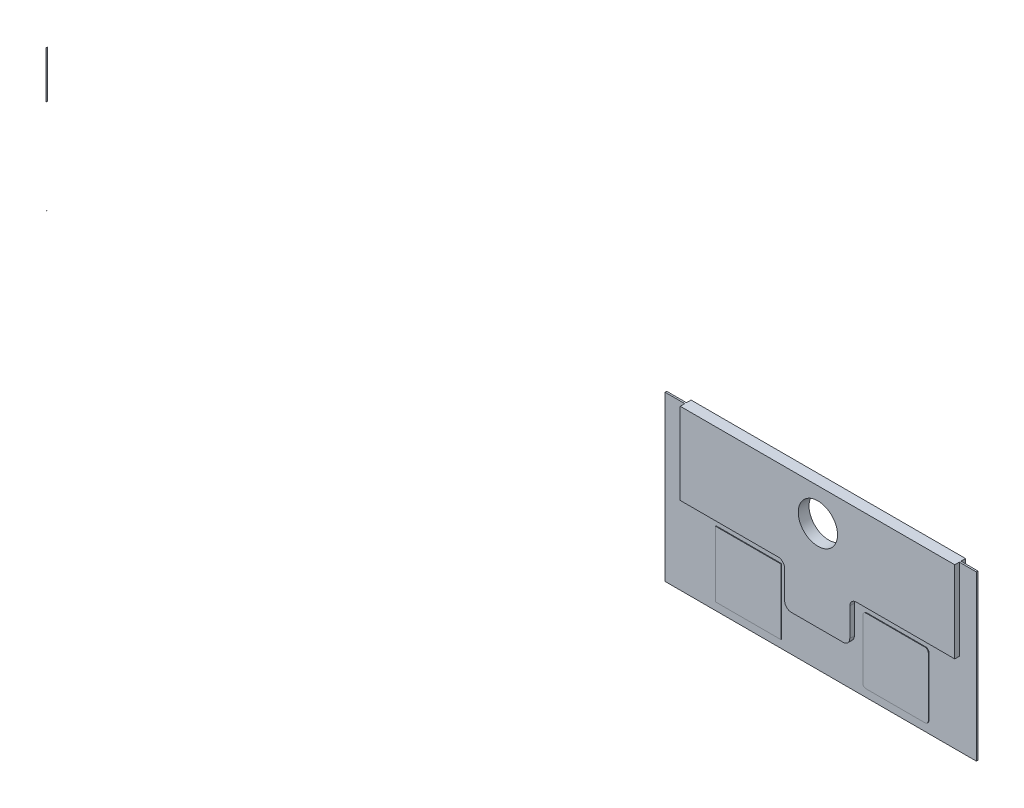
ISO-10303-21;
HEADER;
FILE_DESCRIPTION(('STEP AP214'),'2;1');
FILE_NAME('part.step','',(''),(''),'','','');
FILE_SCHEMA(('AUTOMOTIVE_DESIGN { 1 0 10303 214 1 1 1 1 }'));
ENDSEC;
DATA;
#1=APPLICATION_CONTEXT('core data for automotive mechanical design processes');
#2=APPLICATION_PROTOCOL_DEFINITION('international standard','automotive_design',2000,#1);
#3=PRODUCT_CONTEXT('',#1,'mechanical');
#4=PRODUCT('Part','Part','',(#3));
#5=PRODUCT_RELATED_PRODUCT_CATEGORY('part','',(#4));
#6=PRODUCT_DEFINITION_FORMATION('','',#4);
#7=PRODUCT_DEFINITION_CONTEXT('part definition',#1,'design');
#8=PRODUCT_DEFINITION('design','',#6,#7);
#9=PRODUCT_DEFINITION_SHAPE('','',#8);
#10=(LENGTH_UNIT() NAMED_UNIT(*) SI_UNIT(.MILLI.,.METRE.));
#11=(NAMED_UNIT(*) PLANE_ANGLE_UNIT() SI_UNIT($,.RADIAN.));
#12=(NAMED_UNIT(*) SI_UNIT($,.STERADIAN.) SOLID_ANGLE_UNIT());
#13=UNCERTAINTY_MEASURE_WITH_UNIT(LENGTH_MEASURE(1.E-05),#10,'distance_accuracy_value','');
#14=(GEOMETRIC_REPRESENTATION_CONTEXT(3) GLOBAL_UNCERTAINTY_ASSIGNED_CONTEXT((#13)) GLOBAL_UNIT_ASSIGNED_CONTEXT((#10,
#11,#12)) REPRESENTATION_CONTEXT('',''));
#15=CARTESIAN_POINT('',(0.,0.,0.));
#16=DIRECTION('',(0.,0.,1.));
#17=DIRECTION('',(1.,0.,0.));
#18=AXIS2_PLACEMENT_3D('',#15,#16,#17);
#19=CARTESIAN_POINT('',(0.,0.,0.26416));
#20=DIRECTION('',(0.,0.,1.));
#21=DIRECTION('',(1.,0.,0.));
#22=AXIS2_PLACEMENT_3D('',#19,#20,#21);
#23=PLANE('',#22);
#24=DIRECTION('',(-1.,0.,0.));
#25=VECTOR('',#24,1.);
#26=CARTESIAN_POINT('',(271.018000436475,264.185400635,0.26416));
#27=LINE('',#26,#25);
#28=CARTESIAN_POINT('',(227.604275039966,264.185400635,0.26416));
#29=VERTEX_POINT('',#28);
#30=CARTESIAN_POINT('',(226.283475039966,264.185400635,0.26416));
#31=VERTEX_POINT('',#30);
#32=EDGE_CURVE('E313',#29,#31,#27,.T.);
#33=ORIENTED_EDGE('',*,*,#32,.F.);
#34=DIRECTION('',(0.,-1.,0.));
#35=VECTOR('',#34,1.);
#36=CARTESIAN_POINT('',(227.604275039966,0.,0.26416));
#37=LINE('',#36,#35);
#38=CARTESIAN_POINT('',(227.604275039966,251.47794764,0.26416));
#39=VERTEX_POINT('',#38);
#40=EDGE_CURVE('E302',#29,#39,#37,.T.);
#41=ORIENTED_EDGE('',*,*,#40,.T.);
#42=DIRECTION('',(1.,0.,0.));
#43=VECTOR('',#42,1.);
#44=CARTESIAN_POINT('',(156.337,251.47794764,0.26416));
#45=LINE('',#44,#43);
#46=CARTESIAN_POINT('',(226.283475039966,251.47794764,0.26416));
#47=VERTEX_POINT('',#46);
#48=EDGE_CURVE('E312',#47,#39,#45,.T.);
#49=ORIENTED_EDGE('',*,*,#48,.F.);
#50=DIRECTION('',(0.,-1.,0.));
#51=VECTOR('',#50,1.);
#52=CARTESIAN_POINT('',(226.283475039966,0.,0.26416));
#53=LINE('',#52,#51);
#54=EDGE_CURVE('E405',#31,#47,#53,.T.);
#55=ORIENTED_EDGE('',*,*,#54,.F.);
#56=EDGE_LOOP('',(#33,#41,#49,#55));
#57=FACE_BOUND('',#56,.T.);
#58=ADVANCED_FACE('F97',(#57),#23,.F.);
#59=CARTESIAN_POINT('',(203.474275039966,251.47794764,0.26416));
#60=VERTEX_POINT('',#59);
#61=CARTESIAN_POINT('',(204.998275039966,251.47794764,0.26416));
#62=VERTEX_POINT('',#61);
#63=EDGE_CURVE('E323',#60,#62,#45,.T.);
#64=ORIENTED_EDGE('',*,*,#63,.F.);
#65=DIRECTION('',(0.,1.,0.));
#66=VECTOR('',#65,1.);
#67=CARTESIAN_POINT('',(203.474275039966,0.,0.26416));
#68=LINE('',#67,#66);
#69=CARTESIAN_POINT('',(203.474275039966,264.185400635,0.26416));
#70=VERTEX_POINT('',#69);
#71=EDGE_CURVE('E444',#60,#70,#68,.T.);
#72=ORIENTED_EDGE('',*,*,#71,.T.);
#73=CARTESIAN_POINT('',(204.998275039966,264.185400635,0.26416));
#74=VERTEX_POINT('',#73);
#75=EDGE_CURVE('E331',#74,#70,#27,.T.);
#76=ORIENTED_EDGE('',*,*,#75,.F.);
#77=DIRECTION('',(0.,-1.,0.));
#78=VECTOR('',#77,1.);
#79=CARTESIAN_POINT('',(204.998275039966,0.,0.26416));
#80=LINE('',#79,#78);
#81=EDGE_CURVE('E440',#74,#62,#80,.T.);
#82=ORIENTED_EDGE('',*,*,#81,.T.);
#83=EDGE_LOOP('',(#64,#72,#76,#82));
#84=FACE_BOUND('',#83,.T.);
#85=ADVANCED_FACE('F464',(#84),#23,.F.);
#86=CARTESIAN_POINT('',(0.,0.,0.39116));
#87=DIRECTION('',(0.,0.,1.));
#88=DIRECTION('',(1.,0.,0.));
#89=AXIS2_PLACEMENT_3D('',#86,#87,#88);
#90=PLANE('',#89);
#91=DIRECTION('',(0.,-1.,0.));
#92=VECTOR('',#91,1.);
#93=CARTESIAN_POINT('',(227.604275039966,0.,0.39116));
#94=LINE('',#93,#92);
#95=CARTESIAN_POINT('',(227.604275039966,264.185400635,0.39116));
#96=VERTEX_POINT('',#95);
#97=CARTESIAN_POINT('',(227.604275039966,251.47794764,0.39116));
#98=VERTEX_POINT('',#97);
#99=EDGE_CURVE('E110',#96,#98,#94,.T.);
#100=ORIENTED_EDGE('',*,*,#99,.F.);
#101=DIRECTION('',(-1.,0.,0.));
#102=VECTOR('',#101,1.);
#103=CARTESIAN_POINT('',(271.018000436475,264.185400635,0.39116));
#104=LINE('',#103,#102);
#105=CARTESIAN_POINT('',(226.283475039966,264.185400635,0.39116));
#106=VERTEX_POINT('',#105);
#107=EDGE_CURVE('E380',#96,#106,#104,.T.);
#108=ORIENTED_EDGE('',*,*,#107,.T.);
#109=DIRECTION('',(0.,-1.,0.));
#110=VECTOR('',#109,1.);
#111=CARTESIAN_POINT('',(226.283475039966,0.,0.39116));
#112=LINE('',#111,#110);
#113=CARTESIAN_POINT('',(226.283475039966,257.86194742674,0.39116));
#114=VERTEX_POINT('',#113);
#115=EDGE_CURVE('E377',#106,#114,#112,.T.);
#116=ORIENTED_EDGE('',*,*,#115,.T.);
#117=DIRECTION('',(1.,0.,0.));
#118=VECTOR('',#117,1.);
#119=CARTESIAN_POINT('',(0.,257.86194742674,0.39116));
#120=LINE('',#119,#118);
#121=CARTESIAN_POINT('',(218.650909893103,257.86194742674,0.39116));
#122=VERTEX_POINT('',#121);
#123=EDGE_CURVE('E381',#122,#114,#120,.T.);
#124=ORIENTED_EDGE('',*,*,#123,.F.);
#125=CARTESIAN_POINT('',(218.650909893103,257.35394742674,0.39116));
#126=DIRECTION('',(0.,0.,1.));
#127=DIRECTION('',(1.,0.,0.));
#128=AXIS2_PLACEMENT_3D('',#125,#126,#127);
#129=CIRCLE('',#128,0.508000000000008);
#130=CARTESIAN_POINT('',(218.142909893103,257.35394742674,0.39116));
#131=VERTEX_POINT('',#130);
#132=EDGE_CURVE('E379',#122,#131,#129,.T.);
#133=ORIENTED_EDGE('',*,*,#132,.T.);
#134=DIRECTION('',(0.,-1.,0.));
#135=VECTOR('',#134,1.);
#136=CARTESIAN_POINT('',(218.142909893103,0.,0.39116));
#137=LINE('',#136,#135);
#138=CARTESIAN_POINT('',(218.142909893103,255.16094764,0.39116));
#139=VERTEX_POINT('',#138);
#140=EDGE_CURVE('E387',#131,#139,#137,.T.);
#141=ORIENTED_EDGE('',*,*,#140,.T.);
#142=CARTESIAN_POINT('',(217.634909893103,255.16094764,0.39116));
#143=DIRECTION('',(0.,0.,1.));
#144=DIRECTION('',(1.,0.,0.));
#145=AXIS2_PLACEMENT_3D('',#142,#143,#144);
#146=CIRCLE('',#145,0.508000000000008);
#147=CARTESIAN_POINT('',(217.634909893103,254.65294764,0.39116));
#148=VERTEX_POINT('',#147);
#149=EDGE_CURVE('E389',#139,#148,#146,.F.);
#150=ORIENTED_EDGE('',*,*,#149,.T.);
#151=DIRECTION('',(1.,0.,0.));
#152=VECTOR('',#151,1.);
#153=CARTESIAN_POINT('',(0.,254.65294764,0.39116));
#154=LINE('',#153,#152);
#155=CARTESIAN_POINT('',(213.606791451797,254.65294764,0.39116));
#156=VERTEX_POINT('',#155);
#157=EDGE_CURVE('E392',#156,#148,#154,.T.);
#158=ORIENTED_EDGE('',*,*,#157,.F.);
#159=CARTESIAN_POINT('',(213.606791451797,255.16094764,0.39116));
#160=DIRECTION('',(0.,0.,1.));
#161=DIRECTION('',(1.,0.,0.));
#162=AXIS2_PLACEMENT_3D('',#159,#160,#161);
#163=CIRCLE('',#162,0.508000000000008);
#164=CARTESIAN_POINT('',(213.098791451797,255.16094764,0.39116));
#165=VERTEX_POINT('',#164);
#166=EDGE_CURVE('E391',#156,#165,#163,.F.);
#167=ORIENTED_EDGE('',*,*,#166,.T.);
#168=DIRECTION('',(0.,-1.,0.));
#169=VECTOR('',#168,1.);
#170=CARTESIAN_POINT('',(213.098791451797,0.,0.39116));
#171=LINE('',#170,#169);
#172=CARTESIAN_POINT('',(213.098791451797,257.35394742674,0.39116));
#173=VERTEX_POINT('',#172);
#174=EDGE_CURVE('E371',#173,#165,#171,.T.);
#175=ORIENTED_EDGE('',*,*,#174,.F.);
#176=CARTESIAN_POINT('',(212.590791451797,257.35394742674,0.39116));
#177=DIRECTION('',(0.,0.,1.));
#178=DIRECTION('',(1.,0.,0.));
#179=AXIS2_PLACEMENT_3D('',#176,#177,#178);
#180=CIRCLE('',#179,0.508000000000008);
#181=CARTESIAN_POINT('',(212.590791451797,257.86194742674,0.39116));
#182=VERTEX_POINT('',#181);
#183=EDGE_CURVE('E398',#173,#182,#180,.T.);
#184=ORIENTED_EDGE('',*,*,#183,.T.);
#185=DIRECTION('',(1.,0.,0.));
#186=VECTOR('',#185,1.);
#187=CARTESIAN_POINT('',(0.,257.86194742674,0.39116));
#188=LINE('',#187,#186);
#189=CARTESIAN_POINT('',(204.998275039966,257.86194742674,0.39116));
#190=VERTEX_POINT('',#189);
#191=EDGE_CURVE('E362',#190,#182,#188,.T.);
#192=ORIENTED_EDGE('',*,*,#191,.F.);
#193=DIRECTION('',(0.,-1.,0.));
#194=VECTOR('',#193,1.);
#195=CARTESIAN_POINT('',(204.998275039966,0.,0.39116));
#196=LINE('',#195,#194);
#197=CARTESIAN_POINT('',(204.998275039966,264.185400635,0.39116));
#198=VERTEX_POINT('',#197);
#199=EDGE_CURVE('E363',#198,#190,#196,.T.);
#200=ORIENTED_EDGE('',*,*,#199,.F.);
#201=CARTESIAN_POINT('',(203.474275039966,264.185400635,0.39116));
#202=VERTEX_POINT('',#201);
#203=EDGE_CURVE('E353',#198,#202,#104,.T.);
#204=ORIENTED_EDGE('',*,*,#203,.T.);
#205=DIRECTION('',(0.,1.,0.));
#206=VECTOR('',#205,1.);
#207=CARTESIAN_POINT('',(203.474275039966,0.,0.39116));
#208=LINE('',#207,#206);
#209=CARTESIAN_POINT('',(203.474275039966,251.47794764,0.39116));
#210=VERTEX_POINT('',#209);
#211=EDGE_CURVE('E104',#210,#202,#208,.T.);
#212=ORIENTED_EDGE('',*,*,#211,.F.);
#213=DIRECTION('',(1.,0.,0.));
#214=VECTOR('',#213,1.);
#215=CARTESIAN_POINT('',(156.337,251.47794764,0.39116));
#216=LINE('',#215,#214);
#217=EDGE_CURVE('E443',#210,#98,#216,.T.);
#218=ORIENTED_EDGE('',*,*,#217,.T.);
#219=EDGE_LOOP('',(#100,#108,#116,#124,#133,#141,#150,#158,#167,#175,#184,#192,#200,#204,#212,#218));
#220=FACE_BOUND('',#219,.T.);
#221=DIRECTION('',(1.,0.,0.));
#222=VECTOR('',#221,1.);
#223=CARTESIAN_POINT('',(207.4164,252.11294764,0.39116));
#224=LINE('',#223,#222);
#225=CARTESIAN_POINT('',(207.4164,252.11294764,0.39116));
#226=VERTEX_POINT('',#225);
#227=CARTESIAN_POINT('',(212.4964,252.11294764,0.39116));
#228=VERTEX_POINT('',#227);
#229=EDGE_CURVE('E936',#226,#228,#224,.T.);
#230=ORIENTED_EDGE('',*,*,#229,.F.);
#231=DIRECTION('',(0.,-1.,0.));
#232=VECTOR('',#231,1.);
#233=CARTESIAN_POINT('',(207.4164,257.19294764,0.39116));
#234=LINE('',#233,#232);
#235=CARTESIAN_POINT('',(207.4164,257.19294764,0.39116));
#236=VERTEX_POINT('',#235);
#237=EDGE_CURVE('E931',#236,#226,#234,.T.);
#238=ORIENTED_EDGE('',*,*,#237,.F.);
#239=DIRECTION('',(-1.,0.,0.));
#240=VECTOR('',#239,1.);
#241=CARTESIAN_POINT('',(207.4164,257.19294764,0.39116));
#242=LINE('',#241,#240);
#243=CARTESIAN_POINT('',(212.4964,257.19294764,0.39116));
#244=VERTEX_POINT('',#243);
#245=EDGE_CURVE('E943',#244,#236,#242,.T.);
#246=ORIENTED_EDGE('',*,*,#245,.F.);
#247=DIRECTION('',(0.,1.,0.));
#248=VECTOR('',#247,1.);
#249=CARTESIAN_POINT('',(212.4964,257.19294764,0.39116));
#250=LINE('',#249,#248);
#251=EDGE_CURVE('E939',#228,#244,#250,.T.);
#252=ORIENTED_EDGE('',*,*,#251,.F.);
#253=EDGE_LOOP('',(#230,#238,#246,#252));
#254=FACE_BOUND('',#253,.T.);
#255=DIRECTION('',(0.,-1.,0.));
#256=VECTOR('',#255,1.);
#257=CARTESIAN_POINT('',(218.8464,256.93894764,0.39116));
#258=LINE('',#257,#256);
#259=CARTESIAN_POINT('',(218.8464,256.93894764,0.39116));
#260=VERTEX_POINT('',#259);
#261=CARTESIAN_POINT('',(218.8464,252.36694764,0.39116));
#262=VERTEX_POINT('',#261);
#263=EDGE_CURVE('E971',#260,#262,#258,.T.);
#264=ORIENTED_EDGE('',*,*,#263,.F.);
#265=CARTESIAN_POINT('',(219.1004,256.93894764,0.39116));
#266=DIRECTION('',(0.,0.,1.));
#267=DIRECTION('',(-1.,0.,0.));
#268=AXIS2_PLACEMENT_3D('',#265,#266,#267);
#269=CIRCLE('',#268,0.25399999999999);
#270=CARTESIAN_POINT('',(219.1004,257.19294764,0.39116));
#271=VERTEX_POINT('',#270);
#272=EDGE_CURVE('E452',#271,#260,#269,.T.);
#273=ORIENTED_EDGE('',*,*,#272,.F.);
#274=DIRECTION('',(-1.,0.,0.));
#275=VECTOR('',#274,1.);
#276=CARTESIAN_POINT('',(219.1004,257.19294764,0.39116));
#277=LINE('',#276,#275);
#278=CARTESIAN_POINT('',(223.6724,257.19294764,0.39116));
#279=VERTEX_POINT('',#278);
#280=EDGE_CURVE('E990',#279,#271,#277,.T.);
#281=ORIENTED_EDGE('',*,*,#280,.F.);
#282=CARTESIAN_POINT('',(223.6724,256.93894764,0.39116));
#283=DIRECTION('',(0.,0.,1.));
#284=DIRECTION('',(1.,0.,0.));
#285=AXIS2_PLACEMENT_3D('',#282,#283,#284);
#286=CIRCLE('',#285,0.25399999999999);
#287=CARTESIAN_POINT('',(223.9264,256.93894764,0.39116));
#288=VERTEX_POINT('',#287);
#289=EDGE_CURVE('E986',#288,#279,#286,.T.);
#290=ORIENTED_EDGE('',*,*,#289,.F.);
#291=DIRECTION('',(0.,1.,0.));
#292=VECTOR('',#291,1.);
#293=CARTESIAN_POINT('',(223.9264,256.93894764,0.39116));
#294=LINE('',#293,#292);
#295=CARTESIAN_POINT('',(223.9264,252.36694764,0.39116));
#296=VERTEX_POINT('',#295);
#297=EDGE_CURVE('E983',#296,#288,#294,.T.);
#298=ORIENTED_EDGE('',*,*,#297,.F.);
#299=CARTESIAN_POINT('',(223.6724,252.36694764,0.39116));
#300=DIRECTION('',(0.,0.,1.));
#301=DIRECTION('',(1.,0.,0.));
#302=AXIS2_PLACEMENT_3D('',#299,#300,#301);
#303=CIRCLE('',#302,0.25399999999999);
#304=CARTESIAN_POINT('',(223.6724,252.11294764,0.39116));
#305=VERTEX_POINT('',#304);
#306=EDGE_CURVE('E980',#305,#296,#303,.T.);
#307=ORIENTED_EDGE('',*,*,#306,.F.);
#308=DIRECTION('',(1.,0.,0.));
#309=VECTOR('',#308,1.);
#310=CARTESIAN_POINT('',(219.1004,252.11294764,0.39116));
#311=LINE('',#310,#309);
#312=CARTESIAN_POINT('',(219.1004,252.11294764,0.39116));
#313=VERTEX_POINT('',#312);
#314=EDGE_CURVE('E977',#313,#305,#311,.T.);
#315=ORIENTED_EDGE('',*,*,#314,.F.);
#316=CARTESIAN_POINT('',(219.1004,252.36694764,0.39116));
#317=DIRECTION('',(0.,0.,1.));
#318=DIRECTION('',(-1.,0.,0.));
#319=AXIS2_PLACEMENT_3D('',#316,#317,#318);
#320=CIRCLE('',#319,0.25399999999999);
#321=EDGE_CURVE('E974',#262,#313,#320,.T.);
#322=ORIENTED_EDGE('',*,*,#321,.F.);
#323=EDGE_LOOP('',(#264,#273,#281,#290,#298,#307,#315,#322));
#324=FACE_BOUND('',#323,.T.);
#325=ADVANCED_FACE('F460',(#220,#254,#324),#90,.T.);
#326=CARTESIAN_POINT('',(271.018000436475,264.185400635,0.26416));
#327=DIRECTION('',(0.,1.,0.));
#328=DIRECTION('',(-1.,0.,0.));
#329=AXIS2_PLACEMENT_3D('',#326,#327,#328);
#330=PLANE('',#329);
#331=DIRECTION('',(0.,0.,1.));
#332=VECTOR('',#331,1.);
#333=CARTESIAN_POINT('',(227.604275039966,264.185400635,0.26416));
#334=LINE('',#333,#332);
#335=EDGE_CURVE('E314',#29,#96,#334,.T.);
#336=ORIENTED_EDGE('',*,*,#335,.F.);
#337=ORIENTED_EDGE('',*,*,#32,.T.);
#338=DIRECTION('',(0.,0.,1.));
#339=VECTOR('',#338,1.);
#340=CARTESIAN_POINT('',(226.283475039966,264.185400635,-0.09144));
#341=LINE('',#340,#339);
#342=CARTESIAN_POINT('',(226.283475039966,264.185400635,-0.09144));
#343=VERTEX_POINT('',#342);
#344=EDGE_CURVE('E434',#343,#31,#341,.T.);
#345=ORIENTED_EDGE('',*,*,#344,.F.);
#346=DIRECTION('',(-1.,0.,0.));
#347=VECTOR('',#346,1.);
#348=CARTESIAN_POINT('',(0.,264.185400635,-0.09144));
#349=LINE('',#348,#347);
#350=CARTESIAN_POINT('',(204.998275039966,264.185400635,-0.09144));
#351=VERTEX_POINT('',#350);
#352=EDGE_CURVE('E340',#343,#351,#349,.T.);
#353=ORIENTED_EDGE('',*,*,#352,.T.);
#354=DIRECTION('',(0.,0.,1.));
#355=VECTOR('',#354,1.);
#356=CARTESIAN_POINT('',(204.998275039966,264.185400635,-0.09144));
#357=LINE('',#356,#355);
#358=EDGE_CURVE('E337',#351,#74,#357,.T.);
#359=ORIENTED_EDGE('',*,*,#358,.T.);
#360=ORIENTED_EDGE('',*,*,#75,.T.);
#361=DIRECTION('',(0.,0.,-1.));
#362=VECTOR('',#361,1.);
#363=CARTESIAN_POINT('',(203.474275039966,264.185400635,0.26416));
#364=LINE('',#363,#362);
#365=EDGE_CURVE('E448',#202,#70,#364,.T.);
#366=ORIENTED_EDGE('',*,*,#365,.F.);
#367=ORIENTED_EDGE('',*,*,#203,.F.);
#368=DIRECTION('',(0.,0.,-1.));
#369=VECTOR('',#368,1.);
#370=CARTESIAN_POINT('',(204.998275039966,264.185400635,0.74676));
#371=LINE('',#370,#369);
#372=CARTESIAN_POINT('',(204.998275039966,264.185400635,0.74676));
#373=VERTEX_POINT('',#372);
#374=EDGE_CURVE('E359',#373,#198,#371,.T.);
#375=ORIENTED_EDGE('',*,*,#374,.F.);
#376=DIRECTION('',(1.,0.,0.));
#377=VECTOR('',#376,1.);
#378=CARTESIAN_POINT('',(0.,264.185400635,0.74676));
#379=LINE('',#378,#377);
#380=CARTESIAN_POINT('',(226.283475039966,264.185400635,0.74676));
#381=VERTEX_POINT('',#380);
#382=EDGE_CURVE('E348',#373,#381,#379,.T.);
#383=ORIENTED_EDGE('',*,*,#382,.T.);
#384=DIRECTION('',(0.,0.,-1.));
#385=VECTOR('',#384,1.);
#386=CARTESIAN_POINT('',(226.283475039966,264.185400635,0.74676));
#387=LINE('',#386,#385);
#388=EDGE_CURVE('E343',#381,#106,#387,.T.);
#389=ORIENTED_EDGE('',*,*,#388,.T.);
#390=ORIENTED_EDGE('',*,*,#107,.F.);
#391=EDGE_LOOP('',(#336,#337,#345,#353,#359,#360,#366,#367,#375,#383,#389,#390));
#392=FACE_BOUND('',#391,.T.);
#393=ADVANCED_FACE('F476',(#392),#330,.T.);
#394=CARTESIAN_POINT('',(156.337,251.47794764,0.26416));
#395=DIRECTION('',(0.,-1.,0.));
#396=DIRECTION('',(0.,0.,-1.));
#397=AXIS2_PLACEMENT_3D('',#394,#395,#396);
#398=PLANE('',#397);
#399=DIRECTION('',(0.,0.,-1.));
#400=VECTOR('',#399,1.);
#401=CARTESIAN_POINT('',(227.604275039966,251.47794764,0.26416));
#402=LINE('',#401,#400);
#403=EDGE_CURVE('E13',#98,#39,#402,.T.);
#404=ORIENTED_EDGE('',*,*,#403,.F.);
#405=ORIENTED_EDGE('',*,*,#217,.F.);
#406=DIRECTION('',(0.,0.,1.));
#407=VECTOR('',#406,1.);
#408=CARTESIAN_POINT('',(203.474275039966,251.47794764,0.26416));
#409=LINE('',#408,#407);
#410=EDGE_CURVE('E454',#60,#210,#409,.T.);
#411=ORIENTED_EDGE('',*,*,#410,.F.);
#412=ORIENTED_EDGE('',*,*,#63,.T.);
#413=DIRECTION('',(0.,0.,1.));
#414=VECTOR('',#413,1.);
#415=CARTESIAN_POINT('',(204.998275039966,251.47794764,-0.09144));
#416=LINE('',#415,#414);
#417=CARTESIAN_POINT('',(204.998275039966,251.47794764,-0.09144));
#418=VERTEX_POINT('',#417);
#419=EDGE_CURVE('E437',#418,#62,#416,.T.);
#420=ORIENTED_EDGE('',*,*,#419,.F.);
#421=DIRECTION('',(1.,0.,0.));
#422=VECTOR('',#421,1.);
#423=CARTESIAN_POINT('',(0.,251.47794764,-0.09144));
#424=LINE('',#423,#422);
#425=CARTESIAN_POINT('',(226.283475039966,251.47794764,-0.09144));
#426=VERTEX_POINT('',#425);
#427=EDGE_CURVE('E327',#418,#426,#424,.T.);
#428=ORIENTED_EDGE('',*,*,#427,.T.);
#429=DIRECTION('',(0.,0.,1.));
#430=VECTOR('',#429,1.);
#431=CARTESIAN_POINT('',(226.283475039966,251.47794764,-0.09144));
#432=LINE('',#431,#430);
#433=EDGE_CURVE('E320',#426,#47,#432,.T.);
#434=ORIENTED_EDGE('',*,*,#433,.T.);
#435=ORIENTED_EDGE('',*,*,#48,.T.);
#436=EDGE_LOOP('',(#404,#405,#411,#412,#420,#428,#434,#435));
#437=FACE_BOUND('',#436,.T.);
#438=ADVANCED_FACE('F317',(#437),#398,.T.);
#439=CARTESIAN_POINT('',(215.6714,261.6454,0.26416));
#440=DIRECTION('',(0.,0.,1.));
#441=DIRECTION('',(1.,0.,0.));
#442=AXIS2_PLACEMENT_3D('',#439,#440,#441);
#443=CYLINDRICAL_SURFACE('',#442,1.524);
#444=CARTESIAN_POINT('',(215.6714,261.6454,0.74676));
#445=DIRECTION('',(0.,0.,1.));
#446=DIRECTION('',(1.,0.,0.));
#447=AXIS2_PLACEMENT_3D('',#444,#445,#446);
#448=CIRCLE('',#447,1.524);
#449=CARTESIAN_POINT('',(217.1954,261.6454,0.74676));
#450=VERTEX_POINT('',#449);
#451=EDGE_CURVE('E321',#450,#450,#448,.T.);
#452=ORIENTED_EDGE('',*,*,#451,.T.);
#453=EDGE_LOOP('',(#452));
#454=FACE_BOUND('',#453,.T.);
#455=CARTESIAN_POINT('',(215.6714,261.6454,-0.09144));
#456=DIRECTION('',(0.,0.,-1.));
#457=DIRECTION('',(-1.,0.,0.));
#458=AXIS2_PLACEMENT_3D('',#455,#456,#457);
#459=CIRCLE('',#458,1.524);
#460=CARTESIAN_POINT('',(214.1474,261.6454,-0.09144));
#461=VERTEX_POINT('',#460);
#462=EDGE_CURVE('E325',#461,#461,#459,.T.);
#463=ORIENTED_EDGE('',*,*,#462,.T.);
#464=EDGE_LOOP('',(#463));
#465=FACE_BOUND('',#464,.T.);
#466=ADVANCED_FACE('F483',(#454,#465),#443,.F.);
#467=CARTESIAN_POINT('',(219.1004,256.93894764,0.44196));
#468=DIRECTION('',(0.,0.,-1.));
#469=DIRECTION('',(-1.,0.,0.));
#470=AXIS2_PLACEMENT_3D('',#467,#468,#469);
#471=CYLINDRICAL_SURFACE('',#470,0.25399999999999);
#472=ORIENTED_EDGE('',*,*,#272,.T.);
#473=DIRECTION('',(0.,0.,-1.));
#474=VECTOR('',#473,1.);
#475=CARTESIAN_POINT('',(218.8464,256.93894764,0.44196));
#476=LINE('',#475,#474);
#477=CARTESIAN_POINT('',(218.8464,256.93894764,0.44196));
#478=VERTEX_POINT('',#477);
#479=EDGE_CURVE('E973',#478,#260,#476,.T.);
#480=ORIENTED_EDGE('',*,*,#479,.F.);
#481=CARTESIAN_POINT('',(219.1004,256.93894764,0.44196));
#482=DIRECTION('',(0.,0.,1.));
#483=DIRECTION('',(-1.,0.,0.));
#484=AXIS2_PLACEMENT_3D('',#481,#482,#483);
#485=CIRCLE('',#484,0.25399999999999);
#486=CARTESIAN_POINT('',(219.1004,257.19294764,0.44196));
#487=VERTEX_POINT('',#486);
#488=EDGE_CURVE('E951',#487,#478,#485,.T.);
#489=ORIENTED_EDGE('',*,*,#488,.F.);
#490=DIRECTION('',(0.,0.,-1.));
#491=VECTOR('',#490,1.);
#492=CARTESIAN_POINT('',(219.1004,257.19294764,0.44196));
#493=LINE('',#492,#491);
#494=EDGE_CURVE('E970',#487,#271,#493,.T.);
#495=ORIENTED_EDGE('',*,*,#494,.T.);
#496=EDGE_LOOP('',(#472,#480,#489,#495));
#497=FACE_BOUND('',#496,.T.);
#498=ADVANCED_FACE('F748',(#497),#471,.T.);
#499=CARTESIAN_POINT('',(218.8464,256.93894764,0.44196));
#500=DIRECTION('',(1.,0.,0.));
#501=DIRECTION('',(0.,0.,-1.));
#502=AXIS2_PLACEMENT_3D('',#499,#500,#501);
#503=PLANE('',#502);
#504=ORIENTED_EDGE('',*,*,#263,.T.);
#505=DIRECTION('',(0.,0.,-1.));
#506=VECTOR('',#505,1.);
#507=CARTESIAN_POINT('',(218.8464,252.36694764,0.44196));
#508=LINE('',#507,#506);
#509=CARTESIAN_POINT('',(218.8464,252.36694764,0.44196));
#510=VERTEX_POINT('',#509);
#511=EDGE_CURVE('E976',#510,#262,#508,.T.);
#512=ORIENTED_EDGE('',*,*,#511,.F.);
#513=DIRECTION('',(0.,-1.,0.));
#514=VECTOR('',#513,1.);
#515=CARTESIAN_POINT('',(218.8464,256.93894764,0.44196));
#516=LINE('',#515,#514);
#517=EDGE_CURVE('E954',#478,#510,#516,.T.);
#518=ORIENTED_EDGE('',*,*,#517,.F.);
#519=ORIENTED_EDGE('',*,*,#479,.T.);
#520=EDGE_LOOP('',(#504,#512,#518,#519));
#521=FACE_BOUND('',#520,.T.);
#522=ADVANCED_FACE('F740',(#521),#503,.F.);
#523=CARTESIAN_POINT('',(219.1004,252.36694764,0.44196));
#524=DIRECTION('',(0.,0.,-1.));
#525=DIRECTION('',(-1.,0.,0.));
#526=AXIS2_PLACEMENT_3D('',#523,#524,#525);
#527=CYLINDRICAL_SURFACE('',#526,0.25399999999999);
#528=ORIENTED_EDGE('',*,*,#321,.T.);
#529=DIRECTION('',(0.,0.,-1.));
#530=VECTOR('',#529,1.);
#531=CARTESIAN_POINT('',(219.1004,252.11294764,0.44196));
#532=LINE('',#531,#530);
#533=CARTESIAN_POINT('',(219.1004,252.11294764,0.44196));
#534=VERTEX_POINT('',#533);
#535=EDGE_CURVE('E979',#534,#313,#532,.T.);
#536=ORIENTED_EDGE('',*,*,#535,.F.);
#537=CARTESIAN_POINT('',(219.1004,252.36694764,0.44196));
#538=DIRECTION('',(0.,0.,1.));
#539=DIRECTION('',(-1.,0.,0.));
#540=AXIS2_PLACEMENT_3D('',#537,#538,#539);
#541=CIRCLE('',#540,0.25399999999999);
#542=EDGE_CURVE('E957',#510,#534,#541,.T.);
#543=ORIENTED_EDGE('',*,*,#542,.F.);
#544=ORIENTED_EDGE('',*,*,#511,.T.);
#545=EDGE_LOOP('',(#528,#536,#543,#544));
#546=FACE_BOUND('',#545,.T.);
#547=ADVANCED_FACE('F732',(#546),#527,.T.);
#548=CARTESIAN_POINT('',(219.1004,252.11294764,0.44196));
#549=DIRECTION('',(0.,1.,0.));
#550=DIRECTION('',(0.,0.,1.));
#551=AXIS2_PLACEMENT_3D('',#548,#549,#550);
#552=PLANE('',#551);
#553=ORIENTED_EDGE('',*,*,#314,.T.);
#554=DIRECTION('',(0.,0.,-1.));
#555=VECTOR('',#554,1.);
#556=CARTESIAN_POINT('',(223.6724,252.11294764,0.44196));
#557=LINE('',#556,#555);
#558=CARTESIAN_POINT('',(223.6724,252.11294764,0.44196));
#559=VERTEX_POINT('',#558);
#560=EDGE_CURVE('E982',#559,#305,#557,.T.);
#561=ORIENTED_EDGE('',*,*,#560,.F.);
#562=DIRECTION('',(1.,0.,0.));
#563=VECTOR('',#562,1.);
#564=CARTESIAN_POINT('',(219.1004,252.11294764,0.44196));
#565=LINE('',#564,#563);
#566=EDGE_CURVE('E959',#534,#559,#565,.T.);
#567=ORIENTED_EDGE('',*,*,#566,.F.);
#568=ORIENTED_EDGE('',*,*,#535,.T.);
#569=EDGE_LOOP('',(#553,#561,#567,#568));
#570=FACE_BOUND('',#569,.T.);
#571=ADVANCED_FACE('F724',(#570),#552,.F.);
#572=CARTESIAN_POINT('',(223.6724,252.36694764,0.44196));
#573=DIRECTION('',(0.,0.,-1.));
#574=DIRECTION('',(-1.,0.,0.));
#575=AXIS2_PLACEMENT_3D('',#572,#573,#574);
#576=CYLINDRICAL_SURFACE('',#575,0.25399999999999);
#577=ORIENTED_EDGE('',*,*,#306,.T.);
#578=DIRECTION('',(0.,0.,-1.));
#579=VECTOR('',#578,1.);
#580=CARTESIAN_POINT('',(223.9264,252.36694764,0.44196));
#581=LINE('',#580,#579);
#582=CARTESIAN_POINT('',(223.9264,252.36694764,0.44196));
#583=VERTEX_POINT('',#582);
#584=EDGE_CURVE('E985',#583,#296,#581,.T.);
#585=ORIENTED_EDGE('',*,*,#584,.F.);
#586=CARTESIAN_POINT('',(223.6724,252.36694764,0.44196));
#587=DIRECTION('',(0.,0.,1.));
#588=DIRECTION('',(1.,0.,0.));
#589=AXIS2_PLACEMENT_3D('',#586,#587,#588);
#590=CIRCLE('',#589,0.25399999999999);
#591=EDGE_CURVE('E961',#559,#583,#590,.T.);
#592=ORIENTED_EDGE('',*,*,#591,.F.);
#593=ORIENTED_EDGE('',*,*,#560,.T.);
#594=EDGE_LOOP('',(#577,#585,#592,#593));
#595=FACE_BOUND('',#594,.T.);
#596=ADVANCED_FACE('F716',(#595),#576,.T.);
#597=CARTESIAN_POINT('',(223.9264,256.93894764,0.44196));
#598=DIRECTION('',(-1.,0.,0.));
#599=DIRECTION('',(0.,0.,1.));
#600=AXIS2_PLACEMENT_3D('',#597,#598,#599);
#601=PLANE('',#600);
#602=ORIENTED_EDGE('',*,*,#297,.T.);
#603=DIRECTION('',(0.,0.,-1.));
#604=VECTOR('',#603,1.);
#605=CARTESIAN_POINT('',(223.9264,256.93894764,0.44196));
#606=LINE('',#605,#604);
#607=CARTESIAN_POINT('',(223.9264,256.93894764,0.44196));
#608=VERTEX_POINT('',#607);
#609=EDGE_CURVE('E989',#608,#288,#606,.T.);
#610=ORIENTED_EDGE('',*,*,#609,.F.);
#611=DIRECTION('',(0.,1.,0.));
#612=VECTOR('',#611,1.);
#613=CARTESIAN_POINT('',(223.9264,256.93894764,0.44196));
#614=LINE('',#613,#612);
#615=EDGE_CURVE('E963',#583,#608,#614,.T.);
#616=ORIENTED_EDGE('',*,*,#615,.F.);
#617=ORIENTED_EDGE('',*,*,#584,.T.);
#618=EDGE_LOOP('',(#602,#610,#616,#617));
#619=FACE_BOUND('',#618,.T.);
#620=ADVANCED_FACE('F708',(#619),#601,.F.);
#621=CARTESIAN_POINT('',(223.6724,256.93894764,0.44196));
#622=DIRECTION('',(0.,0.,-1.));
#623=DIRECTION('',(-1.,0.,0.));
#624=AXIS2_PLACEMENT_3D('',#621,#622,#623);
#625=CYLINDRICAL_SURFACE('',#624,0.25399999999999);
#626=ORIENTED_EDGE('',*,*,#289,.T.);
#627=DIRECTION('',(0.,0.,-1.));
#628=VECTOR('',#627,1.);
#629=CARTESIAN_POINT('',(223.6724,257.19294764,0.44196));
#630=LINE('',#629,#628);
#631=CARTESIAN_POINT('',(223.6724,257.19294764,0.44196));
#632=VERTEX_POINT('',#631);
#633=EDGE_CURVE('E955',#632,#279,#630,.T.);
#634=ORIENTED_EDGE('',*,*,#633,.F.);
#635=CARTESIAN_POINT('',(223.6724,256.93894764,0.44196));
#636=DIRECTION('',(0.,0.,1.));
#637=DIRECTION('',(1.,0.,0.));
#638=AXIS2_PLACEMENT_3D('',#635,#636,#637);
#639=CIRCLE('',#638,0.25399999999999);
#640=EDGE_CURVE('E965',#608,#632,#639,.T.);
#641=ORIENTED_EDGE('',*,*,#640,.F.);
#642=ORIENTED_EDGE('',*,*,#609,.T.);
#643=EDGE_LOOP('',(#626,#634,#641,#642));
#644=FACE_BOUND('',#643,.T.);
#645=ADVANCED_FACE('F700',(#644),#625,.T.);
#646=CARTESIAN_POINT('',(219.1004,257.19294764,0.44196));
#647=DIRECTION('',(0.,-1.,0.));
#648=DIRECTION('',(0.,0.,-1.));
#649=AXIS2_PLACEMENT_3D('',#646,#647,#648);
#650=PLANE('',#649);
#651=ORIENTED_EDGE('',*,*,#280,.T.);
#652=ORIENTED_EDGE('',*,*,#494,.F.);
#653=DIRECTION('',(-1.,0.,0.));
#654=VECTOR('',#653,1.);
#655=CARTESIAN_POINT('',(219.1004,257.19294764,0.44196));
#656=LINE('',#655,#654);
#657=EDGE_CURVE('E935',#632,#487,#656,.T.);
#658=ORIENTED_EDGE('',*,*,#657,.F.);
#659=ORIENTED_EDGE('',*,*,#633,.T.);
#660=EDGE_LOOP('',(#651,#652,#658,#659));
#661=FACE_BOUND('',#660,.T.);
#662=ADVANCED_FACE('F692',(#661),#650,.F.);
#663=CARTESIAN_POINT('',(219.1004,256.93894764,0.44196));
#664=DIRECTION('',(0.,0.,-1.));
#665=DIRECTION('',(-1.,0.,0.));
#666=AXIS2_PLACEMENT_3D('',#663,#664,#665);
#667=PLANE('',#666);
#668=ORIENTED_EDGE('',*,*,#488,.T.);
#669=ORIENTED_EDGE('',*,*,#517,.T.);
#670=ORIENTED_EDGE('',*,*,#542,.T.);
#671=ORIENTED_EDGE('',*,*,#566,.T.);
#672=ORIENTED_EDGE('',*,*,#591,.T.);
#673=ORIENTED_EDGE('',*,*,#615,.T.);
#674=ORIENTED_EDGE('',*,*,#640,.T.);
#675=ORIENTED_EDGE('',*,*,#657,.T.);
#676=EDGE_LOOP('',(#668,#669,#670,#671,#672,#673,#674,#675));
#677=FACE_BOUND('',#676,.T.);
#678=ADVANCED_FACE('F684',(#677),#667,.F.);
#679=CARTESIAN_POINT('',(207.4164,257.19294764,0.44196));
#680=DIRECTION('',(1.,0.,0.));
#681=DIRECTION('',(0.,0.,-1.));
#682=AXIS2_PLACEMENT_3D('',#679,#680,#681);
#683=PLANE('',#682);
#684=ORIENTED_EDGE('',*,*,#237,.T.);
#685=DIRECTION('',(0.,0.,-1.));
#686=VECTOR('',#685,1.);
#687=CARTESIAN_POINT('',(207.4164,252.11294764,0.44196));
#688=LINE('',#687,#686);
#689=CARTESIAN_POINT('',(207.4164,252.11294764,0.44196));
#690=VERTEX_POINT('',#689);
#691=EDGE_CURVE('E938',#690,#226,#688,.T.);
#692=ORIENTED_EDGE('',*,*,#691,.F.);
#693=DIRECTION('',(0.,-1.,0.));
#694=VECTOR('',#693,1.);
#695=CARTESIAN_POINT('',(207.4164,257.19294764,0.44196));
#696=LINE('',#695,#694);
#697=CARTESIAN_POINT('',(207.4164,257.19294764,0.44196));
#698=VERTEX_POINT('',#697);
#699=EDGE_CURVE('E922',#698,#690,#696,.T.);
#700=ORIENTED_EDGE('',*,*,#699,.F.);
#701=DIRECTION('',(0.,0.,-1.));
#702=VECTOR('',#701,1.);
#703=CARTESIAN_POINT('',(207.4164,257.19294764,0.44196));
#704=LINE('',#703,#702);
#705=EDGE_CURVE('E934',#698,#236,#704,.T.);
#706=ORIENTED_EDGE('',*,*,#705,.T.);
#707=EDGE_LOOP('',(#684,#692,#700,#706));
#708=FACE_BOUND('',#707,.T.);
#709=ADVANCED_FACE('F676',(#708),#683,.F.);
#710=CARTESIAN_POINT('',(207.4164,252.11294764,0.44196));
#711=DIRECTION('',(0.,1.,0.));
#712=DIRECTION('',(0.,0.,1.));
#713=AXIS2_PLACEMENT_3D('',#710,#711,#712);
#714=PLANE('',#713);
#715=ORIENTED_EDGE('',*,*,#229,.T.);
#716=DIRECTION('',(0.,0.,-1.));
#717=VECTOR('',#716,1.);
#718=CARTESIAN_POINT('',(212.4964,252.11294764,0.44196));
#719=LINE('',#718,#717);
#720=CARTESIAN_POINT('',(212.4964,252.11294764,0.44196));
#721=VERTEX_POINT('',#720);
#722=EDGE_CURVE('E942',#721,#228,#719,.T.);
#723=ORIENTED_EDGE('',*,*,#722,.F.);
#724=DIRECTION('',(1.,0.,0.));
#725=VECTOR('',#724,1.);
#726=CARTESIAN_POINT('',(207.4164,252.11294764,0.44196));
#727=LINE('',#726,#725);
#728=EDGE_CURVE('E925',#690,#721,#727,.T.);
#729=ORIENTED_EDGE('',*,*,#728,.F.);
#730=ORIENTED_EDGE('',*,*,#691,.T.);
#731=EDGE_LOOP('',(#715,#723,#729,#730));
#732=FACE_BOUND('',#731,.T.);
#733=ADVANCED_FACE('F668',(#732),#714,.F.);
#734=CARTESIAN_POINT('',(212.4964,257.19294764,0.44196));
#735=DIRECTION('',(-1.,0.,0.));
#736=DIRECTION('',(0.,0.,1.));
#737=AXIS2_PLACEMENT_3D('',#734,#735,#736);
#738=PLANE('',#737);
#739=ORIENTED_EDGE('',*,*,#251,.T.);
#740=DIRECTION('',(0.,0.,-1.));
#741=VECTOR('',#740,1.);
#742=CARTESIAN_POINT('',(212.4964,257.19294764,0.44196));
#743=LINE('',#742,#741);
#744=CARTESIAN_POINT('',(212.4964,257.19294764,0.44196));
#745=VERTEX_POINT('',#744);
#746=EDGE_CURVE('E926',#745,#244,#743,.T.);
#747=ORIENTED_EDGE('',*,*,#746,.F.);
#748=DIRECTION('',(0.,1.,0.));
#749=VECTOR('',#748,1.);
#750=CARTESIAN_POINT('',(212.4964,257.19294764,0.44196));
#751=LINE('',#750,#749);
#752=EDGE_CURVE('E928',#721,#745,#751,.T.);
#753=ORIENTED_EDGE('',*,*,#752,.F.);
#754=ORIENTED_EDGE('',*,*,#722,.T.);
#755=EDGE_LOOP('',(#739,#747,#753,#754));
#756=FACE_BOUND('',#755,.T.);
#757=ADVANCED_FACE('F660',(#756),#738,.F.);
#758=CARTESIAN_POINT('',(207.4164,257.19294764,0.44196));
#759=DIRECTION('',(0.,-1.,0.));
#760=DIRECTION('',(0.,0.,-1.));
#761=AXIS2_PLACEMENT_3D('',#758,#759,#760);
#762=PLANE('',#761);
#763=ORIENTED_EDGE('',*,*,#245,.T.);
#764=ORIENTED_EDGE('',*,*,#705,.F.);
#765=DIRECTION('',(-1.,0.,0.));
#766=VECTOR('',#765,1.);
#767=CARTESIAN_POINT('',(207.4164,257.19294764,0.44196));
#768=LINE('',#767,#766);
#769=EDGE_CURVE('E432',#745,#698,#768,.T.);
#770=ORIENTED_EDGE('',*,*,#769,.F.);
#771=ORIENTED_EDGE('',*,*,#746,.T.);
#772=EDGE_LOOP('',(#763,#764,#770,#771));
#773=FACE_BOUND('',#772,.T.);
#774=ADVANCED_FACE('F652',(#773),#762,.F.);
#775=CARTESIAN_POINT('',(0.,0.,0.44196));
#776=DIRECTION('',(0.,0.,1.));
#777=DIRECTION('',(1.,0.,0.));
#778=AXIS2_PLACEMENT_3D('',#775,#776,#777);
#779=PLANE('',#778);
#780=ORIENTED_EDGE('',*,*,#699,.T.);
#781=ORIENTED_EDGE('',*,*,#728,.T.);
#782=ORIENTED_EDGE('',*,*,#752,.T.);
#783=ORIENTED_EDGE('',*,*,#769,.T.);
#784=EDGE_LOOP('',(#780,#781,#782,#783));
#785=FACE_BOUND('',#784,.T.);
#786=ADVANCED_FACE('F644',(#785),#779,.T.);
#787=CARTESIAN_POINT('',(212.590791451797,257.35394742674,0.74676));
#788=DIRECTION('',(0.,0.,-1.));
#789=DIRECTION('',(-1.,0.,0.));
#790=AXIS2_PLACEMENT_3D('',#787,#788,#789);
#791=CYLINDRICAL_SURFACE('',#790,0.508000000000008);
#792=ORIENTED_EDGE('',*,*,#183,.F.);
#793=DIRECTION('',(0.,0.,-1.));
#794=VECTOR('',#793,1.);
#795=CARTESIAN_POINT('',(213.098791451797,257.35394742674,0.74676));
#796=LINE('',#795,#794);
#797=CARTESIAN_POINT('',(213.098791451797,257.35394742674,0.74676));
#798=VERTEX_POINT('',#797);
#799=EDGE_CURVE('E401',#798,#173,#796,.T.);
#800=ORIENTED_EDGE('',*,*,#799,.F.);
#801=CARTESIAN_POINT('',(212.590791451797,257.35394742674,0.74676));
#802=DIRECTION('',(0.,0.,1.));
#803=DIRECTION('',(1.,0.,0.));
#804=AXIS2_PLACEMENT_3D('',#801,#802,#803);
#805=CIRCLE('',#804,0.508000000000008);
#806=CARTESIAN_POINT('',(212.590791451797,257.86194742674,0.74676));
#807=VERTEX_POINT('',#806);
#808=EDGE_CURVE('E372',#798,#807,#805,.T.);
#809=ORIENTED_EDGE('',*,*,#808,.T.);
#810=DIRECTION('',(0.,0.,-1.));
#811=VECTOR('',#810,1.);
#812=CARTESIAN_POINT('',(212.590791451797,257.86194742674,0.74676));
#813=LINE('',#812,#811);
#814=EDGE_CURVE('E368',#807,#182,#813,.T.);
#815=ORIENTED_EDGE('',*,*,#814,.T.);
#816=EDGE_LOOP('',(#792,#800,#809,#815));
#817=FACE_BOUND('',#816,.T.);
#818=ADVANCED_FACE('F636',(#817),#791,.F.);
#819=CARTESIAN_POINT('',(213.098791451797,0.,0.74676));
#820=DIRECTION('',(1.,0.,0.));
#821=DIRECTION('',(0.,0.,-1.));
#822=AXIS2_PLACEMENT_3D('',#819,#820,#821);
#823=PLANE('',#822);
#824=ORIENTED_EDGE('',*,*,#174,.T.);
#825=DIRECTION('',(0.,0.,-1.));
#826=VECTOR('',#825,1.);
#827=CARTESIAN_POINT('',(213.098791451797,255.16094764,0.74676));
#828=LINE('',#827,#826);
#829=CARTESIAN_POINT('',(213.098791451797,255.16094764,0.74676));
#830=VERTEX_POINT('',#829);
#831=EDGE_CURVE('E396',#830,#165,#828,.T.);
#832=ORIENTED_EDGE('',*,*,#831,.F.);
#833=DIRECTION('',(0.,-1.,0.));
#834=VECTOR('',#833,1.);
#835=CARTESIAN_POINT('',(213.098791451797,0.,0.74676));
#836=LINE('',#835,#834);
#837=EDGE_CURVE('E367',#798,#830,#836,.T.);
#838=ORIENTED_EDGE('',*,*,#837,.F.);
#839=ORIENTED_EDGE('',*,*,#799,.T.);
#840=EDGE_LOOP('',(#824,#832,#838,#839));
#841=FACE_BOUND('',#840,.T.);
#842=ADVANCED_FACE('F628',(#841),#823,.F.);
#843=CARTESIAN_POINT('',(213.606791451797,255.16094764,0.74676));
#844=DIRECTION('',(0.,0.,-1.));
#845=DIRECTION('',(-1.,0.,0.));
#846=AXIS2_PLACEMENT_3D('',#843,#844,#845);
#847=CYLINDRICAL_SURFACE('',#846,0.508000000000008);
#848=ORIENTED_EDGE('',*,*,#166,.F.);
#849=DIRECTION('',(0.,0.,-1.));
#850=VECTOR('',#849,1.);
#851=CARTESIAN_POINT('',(213.606791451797,254.65294764,0.74676));
#852=LINE('',#851,#850);
#853=CARTESIAN_POINT('',(213.606791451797,254.65294764,0.74676));
#854=VERTEX_POINT('',#853);
#855=EDGE_CURVE('E395',#854,#156,#852,.T.);
#856=ORIENTED_EDGE('',*,*,#855,.F.);
#857=CARTESIAN_POINT('',(213.606791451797,255.16094764,0.74676));
#858=DIRECTION('',(0.,0.,1.));
#859=DIRECTION('',(1.,0.,0.));
#860=AXIS2_PLACEMENT_3D('',#857,#858,#859);
#861=CIRCLE('',#860,0.508000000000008);
#862=EDGE_CURVE('E427',#854,#830,#861,.F.);
#863=ORIENTED_EDGE('',*,*,#862,.T.);
#864=ORIENTED_EDGE('',*,*,#831,.T.);
#865=EDGE_LOOP('',(#848,#856,#863,#864));
#866=FACE_BOUND('',#865,.T.);
#867=ADVANCED_FACE('F620',(#866),#847,.T.);
#868=CARTESIAN_POINT('',(0.,254.65294764,0.74676));
#869=DIRECTION('',(0.,1.,0.));
#870=DIRECTION('',(0.,0.,1.));
#871=AXIS2_PLACEMENT_3D('',#868,#869,#870);
#872=PLANE('',#871);
#873=ORIENTED_EDGE('',*,*,#157,.T.);
#874=DIRECTION('',(0.,0.,-1.));
#875=VECTOR('',#874,1.);
#876=CARTESIAN_POINT('',(217.634909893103,254.65294764,0.74676));
#877=LINE('',#876,#875);
#878=CARTESIAN_POINT('',(217.634909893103,254.65294764,0.74676));
#879=VERTEX_POINT('',#878);
#880=EDGE_CURVE('E422',#879,#148,#877,.T.);
#881=ORIENTED_EDGE('',*,*,#880,.F.);
#882=DIRECTION('',(1.,0.,0.));
#883=VECTOR('',#882,1.);
#884=CARTESIAN_POINT('',(0.,254.65294764,0.74676));
#885=LINE('',#884,#883);
#886=EDGE_CURVE('E414',#854,#879,#885,.T.);
#887=ORIENTED_EDGE('',*,*,#886,.F.);
#888=ORIENTED_EDGE('',*,*,#855,.T.);
#889=EDGE_LOOP('',(#873,#881,#887,#888));
#890=FACE_BOUND('',#889,.T.);
#891=ADVANCED_FACE('F612',(#890),#872,.F.);
#892=CARTESIAN_POINT('',(217.634909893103,255.16094764,0.74676));
#893=DIRECTION('',(0.,0.,-1.));
#894=DIRECTION('',(-1.,0.,0.));
#895=AXIS2_PLACEMENT_3D('',#892,#893,#894);
#896=CYLINDRICAL_SURFACE('',#895,0.508000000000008);
#897=ORIENTED_EDGE('',*,*,#149,.F.);
#898=DIRECTION('',(0.,0.,-1.));
#899=VECTOR('',#898,1.);
#900=CARTESIAN_POINT('',(218.142909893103,255.16094764,0.74676));
#901=LINE('',#900,#899);
#902=CARTESIAN_POINT('',(218.142909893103,255.16094764,0.74676));
#903=VERTEX_POINT('',#902);
#904=EDGE_CURVE('E418',#903,#139,#901,.T.);
#905=ORIENTED_EDGE('',*,*,#904,.F.);
#906=CARTESIAN_POINT('',(217.634909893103,255.16094764,0.74676));
#907=DIRECTION('',(0.,0.,1.));
#908=DIRECTION('',(1.,0.,0.));
#909=AXIS2_PLACEMENT_3D('',#906,#907,#908);
#910=CIRCLE('',#909,0.508000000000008);
#911=EDGE_CURVE('E423',#903,#879,#910,.F.);
#912=ORIENTED_EDGE('',*,*,#911,.T.);
#913=ORIENTED_EDGE('',*,*,#880,.T.);
#914=EDGE_LOOP('',(#897,#905,#912,#913));
#915=FACE_BOUND('',#914,.T.);
#916=ADVANCED_FACE('F604',(#915),#896,.T.);
#917=CARTESIAN_POINT('',(218.142909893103,0.,0.74676));
#918=DIRECTION('',(1.,0.,0.));
#919=DIRECTION('',(0.,0.,-1.));
#920=AXIS2_PLACEMENT_3D('',#917,#918,#919);
#921=PLANE('',#920);
#922=ORIENTED_EDGE('',*,*,#140,.F.);
#923=DIRECTION('',(0.,0.,-1.));
#924=VECTOR('',#923,1.);
#925=CARTESIAN_POINT('',(218.142909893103,257.35394742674,0.74676));
#926=LINE('',#925,#924);
#927=CARTESIAN_POINT('',(218.142909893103,257.35394742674,0.74676));
#928=VERTEX_POINT('',#927);
#929=EDGE_CURVE('E385',#928,#131,#926,.T.);
#930=ORIENTED_EDGE('',*,*,#929,.F.);
#931=DIRECTION('',(0.,-1.,0.));
#932=VECTOR('',#931,1.);
#933=CARTESIAN_POINT('',(218.142909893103,0.,0.74676));
#934=LINE('',#933,#932);
#935=EDGE_CURVE('E419',#928,#903,#934,.T.);
#936=ORIENTED_EDGE('',*,*,#935,.T.);
#937=ORIENTED_EDGE('',*,*,#904,.T.);
#938=EDGE_LOOP('',(#922,#930,#936,#937));
#939=FACE_BOUND('',#938,.T.);
#940=ADVANCED_FACE('F596',(#939),#921,.T.);
#941=CARTESIAN_POINT('',(218.650909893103,257.35394742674,0.74676));
#942=DIRECTION('',(0.,0.,-1.));
#943=DIRECTION('',(-1.,0.,0.));
#944=AXIS2_PLACEMENT_3D('',#941,#942,#943);
#945=CYLINDRICAL_SURFACE('',#944,0.508000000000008);
#946=ORIENTED_EDGE('',*,*,#132,.F.);
#947=DIRECTION('',(0.,0.,-1.));
#948=VECTOR('',#947,1.);
#949=CARTESIAN_POINT('',(218.650909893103,257.86194742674,0.74676));
#950=LINE('',#949,#948);
#951=CARTESIAN_POINT('',(218.650909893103,257.86194742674,0.74676));
#952=VERTEX_POINT('',#951);
#953=EDGE_CURVE('E384',#952,#122,#950,.T.);
#954=ORIENTED_EDGE('',*,*,#953,.F.);
#955=CARTESIAN_POINT('',(218.650909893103,257.35394742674,0.74676));
#956=DIRECTION('',(0.,0.,1.));
#957=DIRECTION('',(1.,0.,0.));
#958=AXIS2_PLACEMENT_3D('',#955,#956,#957);
#959=CIRCLE('',#958,0.508000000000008);
#960=EDGE_CURVE('E415',#952,#928,#959,.T.);
#961=ORIENTED_EDGE('',*,*,#960,.T.);
#962=ORIENTED_EDGE('',*,*,#929,.T.);
#963=EDGE_LOOP('',(#946,#954,#961,#962));
#964=FACE_BOUND('',#963,.T.);
#965=ADVANCED_FACE('F588',(#964),#945,.F.);
#966=CARTESIAN_POINT('',(0.,257.86194742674,0.74676));
#967=DIRECTION('',(0.,1.,0.));
#968=DIRECTION('',(0.,0.,1.));
#969=AXIS2_PLACEMENT_3D('',#966,#967,#968);
#970=PLANE('',#969);
#971=ORIENTED_EDGE('',*,*,#123,.T.);
#972=DIRECTION('',(0.,0.,-1.));
#973=VECTOR('',#972,1.);
#974=CARTESIAN_POINT('',(226.283475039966,257.86194742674,0.74676));
#975=LINE('',#974,#973);
#976=CARTESIAN_POINT('',(226.283475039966,257.86194742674,0.74676));
#977=VERTEX_POINT('',#976);
#978=EDGE_CURVE('E357',#977,#114,#975,.T.);
#979=ORIENTED_EDGE('',*,*,#978,.F.);
#980=DIRECTION('',(1.,0.,0.));
#981=VECTOR('',#980,1.);
#982=CARTESIAN_POINT('',(0.,257.86194742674,0.74676));
#983=LINE('',#982,#981);
#984=EDGE_CURVE('E408',#952,#977,#983,.T.);
#985=ORIENTED_EDGE('',*,*,#984,.F.);
#986=ORIENTED_EDGE('',*,*,#953,.T.);
#987=EDGE_LOOP('',(#971,#979,#985,#986));
#988=FACE_BOUND('',#987,.T.);
#989=ADVANCED_FACE('F580',(#988),#970,.F.);
#990=CARTESIAN_POINT('',(226.283475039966,0.,0.74676));
#991=DIRECTION('',(1.,0.,0.));
#992=DIRECTION('',(0.,0.,-1.));
#993=AXIS2_PLACEMENT_3D('',#990,#991,#992);
#994=PLANE('',#993);
#995=ORIENTED_EDGE('',*,*,#115,.F.);
#996=ORIENTED_EDGE('',*,*,#388,.F.);
#997=DIRECTION('',(0.,-1.,0.));
#998=VECTOR('',#997,1.);
#999=CARTESIAN_POINT('',(226.283475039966,0.,0.74676));
#1000=LINE('',#999,#998);
#1001=EDGE_CURVE('E410',#381,#977,#1000,.T.);
#1002=ORIENTED_EDGE('',*,*,#1001,.T.);
#1003=ORIENTED_EDGE('',*,*,#978,.T.);
#1004=EDGE_LOOP('',(#995,#996,#1002,#1003));
#1005=FACE_BOUND('',#1004,.T.);
#1006=ADVANCED_FACE('F572',(#1005),#994,.T.);
#1007=CARTESIAN_POINT('',(204.998275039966,0.,0.74676));
#1008=DIRECTION('',(1.,0.,0.));
#1009=DIRECTION('',(0.,0.,-1.));
#1010=AXIS2_PLACEMENT_3D('',#1007,#1008,#1009);
#1011=PLANE('',#1010);
#1012=ORIENTED_EDGE('',*,*,#199,.T.);
#1013=DIRECTION('',(0.,0.,-1.));
#1014=VECTOR('',#1013,1.);
#1015=CARTESIAN_POINT('',(204.998275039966,257.86194742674,0.74676));
#1016=LINE('',#1015,#1014);
#1017=CARTESIAN_POINT('',(204.998275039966,257.86194742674,0.74676));
#1018=VERTEX_POINT('',#1017);
#1019=EDGE_CURVE('E364',#1018,#190,#1016,.T.);
#1020=ORIENTED_EDGE('',*,*,#1019,.F.);
#1021=DIRECTION('',(0.,-1.,0.));
#1022=VECTOR('',#1021,1.);
#1023=CARTESIAN_POINT('',(204.998275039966,0.,0.74676));
#1024=LINE('',#1023,#1022);
#1025=EDGE_CURVE('E406',#373,#1018,#1024,.T.);
#1026=ORIENTED_EDGE('',*,*,#1025,.F.);
#1027=ORIENTED_EDGE('',*,*,#374,.T.);
#1028=EDGE_LOOP('',(#1012,#1020,#1026,#1027));
#1029=FACE_BOUND('',#1028,.T.);
#1030=ADVANCED_FACE('F564',(#1029),#1011,.F.);
#1031=CARTESIAN_POINT('',(0.,257.86194742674,0.74676));
#1032=DIRECTION('',(0.,1.,0.));
#1033=DIRECTION('',(0.,0.,1.));
#1034=AXIS2_PLACEMENT_3D('',#1031,#1032,#1033);
#1035=PLANE('',#1034);
#1036=ORIENTED_EDGE('',*,*,#191,.T.);
#1037=ORIENTED_EDGE('',*,*,#814,.F.);
#1038=DIRECTION('',(1.,0.,0.));
#1039=VECTOR('',#1038,1.);
#1040=CARTESIAN_POINT('',(0.,257.86194742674,0.74676));
#1041=LINE('',#1040,#1039);
#1042=EDGE_CURVE('E403',#1018,#807,#1041,.T.);
#1043=ORIENTED_EDGE('',*,*,#1042,.F.);
#1044=ORIENTED_EDGE('',*,*,#1019,.T.);
#1045=EDGE_LOOP('',(#1036,#1037,#1043,#1044));
#1046=FACE_BOUND('',#1045,.T.);
#1047=ADVANCED_FACE('F556',(#1046),#1035,.F.);
#1048=CARTESIAN_POINT('',(0.,0.,0.74676));
#1049=DIRECTION('',(0.,0.,1.));
#1050=DIRECTION('',(1.,0.,0.));
#1051=AXIS2_PLACEMENT_3D('',#1048,#1049,#1050);
#1052=PLANE('',#1051);
#1053=ORIENTED_EDGE('',*,*,#451,.F.);
#1054=EDGE_LOOP('',(#1053));
#1055=FACE_BOUND('',#1054,.T.);
#1056=ORIENTED_EDGE('',*,*,#808,.F.);
#1057=ORIENTED_EDGE('',*,*,#837,.T.);
#1058=ORIENTED_EDGE('',*,*,#862,.F.);
#1059=ORIENTED_EDGE('',*,*,#886,.T.);
#1060=ORIENTED_EDGE('',*,*,#911,.F.);
#1061=ORIENTED_EDGE('',*,*,#935,.F.);
#1062=ORIENTED_EDGE('',*,*,#960,.F.);
#1063=ORIENTED_EDGE('',*,*,#984,.T.);
#1064=ORIENTED_EDGE('',*,*,#1001,.F.);
#1065=ORIENTED_EDGE('',*,*,#382,.F.);
#1066=ORIENTED_EDGE('',*,*,#1025,.T.);
#1067=ORIENTED_EDGE('',*,*,#1042,.T.);
#1068=EDGE_LOOP('',(#1056,#1057,#1058,#1059,#1060,#1061,#1062,#1063,#1064,#1065,#1066,#1067));
#1069=FACE_BOUND('',#1068,.T.);
#1070=ADVANCED_FACE('F549',(#1055,#1069),#1052,.T.);
#1071=CARTESIAN_POINT('',(226.283475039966,0.,-0.09144));
#1072=DIRECTION('',(-1.,0.,0.));
#1073=DIRECTION('',(0.,0.,1.));
#1074=AXIS2_PLACEMENT_3D('',#1071,#1072,#1073);
#1075=PLANE('',#1074);
#1076=ORIENTED_EDGE('',*,*,#54,.T.);
#1077=ORIENTED_EDGE('',*,*,#433,.F.);
#1078=DIRECTION('',(0.,-1.,0.));
#1079=VECTOR('',#1078,1.);
#1080=CARTESIAN_POINT('',(226.283475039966,0.,-0.09144));
#1081=LINE('',#1080,#1079);
#1082=EDGE_CURVE('E438',#343,#426,#1081,.T.);
#1083=ORIENTED_EDGE('',*,*,#1082,.F.);
#1084=ORIENTED_EDGE('',*,*,#344,.T.);
#1085=EDGE_LOOP('',(#1076,#1077,#1083,#1084));
#1086=FACE_BOUND('',#1085,.T.);
#1087=ADVANCED_FACE('F475',(#1086),#1075,.F.);
#1088=CARTESIAN_POINT('',(204.998275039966,0.,-0.09144));
#1089=DIRECTION('',(-1.,0.,0.));
#1090=DIRECTION('',(0.,0.,1.));
#1091=AXIS2_PLACEMENT_3D('',#1088,#1089,#1090);
#1092=PLANE('',#1091);
#1093=ORIENTED_EDGE('',*,*,#81,.F.);
#1094=ORIENTED_EDGE('',*,*,#358,.F.);
#1095=DIRECTION('',(0.,-1.,0.));
#1096=VECTOR('',#1095,1.);
#1097=CARTESIAN_POINT('',(204.998275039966,0.,-0.09144));
#1098=LINE('',#1097,#1096);
#1099=EDGE_CURVE('E435',#351,#418,#1098,.T.);
#1100=ORIENTED_EDGE('',*,*,#1099,.T.);
#1101=ORIENTED_EDGE('',*,*,#419,.T.);
#1102=EDGE_LOOP('',(#1093,#1094,#1100,#1101));
#1103=FACE_BOUND('',#1102,.T.);
#1104=ADVANCED_FACE('F467',(#1103),#1092,.T.);
#1105=CARTESIAN_POINT('',(0.,0.,-0.09144));
#1106=DIRECTION('',(0.,0.,-1.));
#1107=DIRECTION('',(-1.,0.,0.));
#1108=AXIS2_PLACEMENT_3D('',#1105,#1106,#1107);
#1109=PLANE('',#1108);
#1110=ORIENTED_EDGE('',*,*,#462,.F.);
#1111=EDGE_LOOP('',(#1110));
#1112=FACE_BOUND('',#1111,.T.);
#1113=ORIENTED_EDGE('',*,*,#352,.F.);
#1114=ORIENTED_EDGE('',*,*,#1082,.T.);
#1115=ORIENTED_EDGE('',*,*,#427,.F.);
#1116=ORIENTED_EDGE('',*,*,#1099,.F.);
#1117=EDGE_LOOP('',(#1113,#1114,#1115,#1116));
#1118=FACE_BOUND('',#1117,.T.);
#1119=ADVANCED_FACE('F472',(#1112,#1118),#1109,.T.);
#1120=CARTESIAN_POINT('',(203.474275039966,267.569481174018,-1.79324));
#1121=DIRECTION('',(1.,0.,0.));
#1122=DIRECTION('',(0.,0.,-1.));
#1123=AXIS2_PLACEMENT_3D('',#1120,#1121,#1122);
#1124=PLANE('',#1123);
#1125=ORIENTED_EDGE('',*,*,#365,.T.);
#1126=ORIENTED_EDGE('',*,*,#71,.F.);
#1127=ORIENTED_EDGE('',*,*,#410,.T.);
#1128=ORIENTED_EDGE('',*,*,#211,.T.);
#1129=EDGE_LOOP('',(#1125,#1126,#1127,#1128));
#1130=FACE_BOUND('',#1129,.T.);
#1131=ADVANCED_FACE('F522',(#1130),#1124,.F.);
#1132=CARTESIAN_POINT('',(227.604275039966,268.30006764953,-1.79324));
#1133=DIRECTION('',(-1.,0.,0.));
#1134=DIRECTION('',(0.,0.,1.));
#1135=AXIS2_PLACEMENT_3D('',#1132,#1133,#1134);
#1136=PLANE('',#1135);
#1137=ORIENTED_EDGE('',*,*,#335,.T.);
#1138=ORIENTED_EDGE('',*,*,#99,.T.);
#1139=ORIENTED_EDGE('',*,*,#403,.T.);
#1140=ORIENTED_EDGE('',*,*,#40,.F.);
#1141=EDGE_LOOP('',(#1137,#1138,#1139,#1140));
#1142=FACE_BOUND('',#1141,.T.);
#1143=ADVANCED_FACE('F301',(#1142),#1136,.F.);
#1144=CLOSED_SHELL('',(#58,#85,#325,#393,#438,#466,#498,#522,#547,#571,#596,#620,#645,#662,#678,
#709,#733,#757,#774,#786,#818,#842,#867,#891,#916,#940,#965,#989,#1006,#1030,#1047,#1070,#1087,
#1104,#1119,#1131,#1143));
#1145=MANIFOLD_SOLID_BREP('B2',#1144);
#1146=CARTESIAN_POINT('',(0.,0.,0.39116));
#1147=DIRECTION('',(0.,0.,1.));
#1148=DIRECTION('',(1.,0.,0.));
#1149=AXIS2_PLACEMENT_3D('',#1146,#1147,#1148);
#1150=PLANE('',#1149);
#1151=DIRECTION('',(0.,-1.,0.));
#1152=VECTOR('',#1151,1.);
#1153=CARTESIAN_POINT('',(155.468275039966,0.,0.39116));
#1154=LINE('',#1153,#1152);
#1155=CARTESIAN_POINT('',(155.468275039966,252.349,0.39116));
#1156=VERTEX_POINT('',#1155);
#1157=CARTESIAN_POINT('',(155.468275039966,252.331321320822,0.39116));
#1158=VERTEX_POINT('',#1157);
#1159=EDGE_CURVE('E1072',#1156,#1158,#1154,.T.);
#1160=ORIENTED_EDGE('',*,*,#1159,.F.);
#1161=DIRECTION('',(-1.,0.,0.));
#1162=VECTOR('',#1161,1.);
#1163=CARTESIAN_POINT('',(155.4734,252.349,0.39116));
#1164=LINE('',#1163,#1162);
#1165=CARTESIAN_POINT('',(155.46594764,252.349,0.39116));
#1166=VERTEX_POINT('',#1165);
#1167=EDGE_CURVE('E1099',#1156,#1166,#1164,.T.);
#1168=ORIENTED_EDGE('',*,*,#1167,.T.);
#1169=DIRECTION('',(0.130523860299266,-0.991445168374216,0.));
#1170=VECTOR('',#1169,1.);
#1171=CARTESIAN_POINT('',(155.46594764,252.349,0.39116));
#1172=LINE('',#1171,#1170);
#1173=EDGE_CURVE('E1102',#1166,#1158,#1172,.T.);
#1174=ORIENTED_EDGE('',*,*,#1173,.T.);
#1175=EDGE_LOOP('',(#1160,#1168,#1174));
#1176=FACE_BOUND('',#1175,.T.);
#1177=ADVANCED_FACE('F1068',(#1176),#1150,.T.);
#1178=CARTESIAN_POINT('',(155.46594764,252.349,0.26416));
#1179=DIRECTION('',(-0.991445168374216,-0.130523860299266,0.));
#1180=DIRECTION('',(0.130523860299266,-0.991445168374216,0.));
#1181=AXIS2_PLACEMENT_3D('',#1178,#1179,#1180);
#1182=PLANE('',#1181);
#1183=DIRECTION('',(0.,0.,-1.));
#1184=VECTOR('',#1183,1.);
#1185=CARTESIAN_POINT('',(155.468275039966,252.331321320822,0.26416));
#1186=LINE('',#1185,#1184);
#1187=CARTESIAN_POINT('',(155.468275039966,252.331321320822,0.26416));
#1188=VERTEX_POINT('',#1187);
#1189=EDGE_CURVE('E95',#1158,#1188,#1186,.T.);
#1190=ORIENTED_EDGE('',*,*,#1189,.F.);
#1191=ORIENTED_EDGE('',*,*,#1173,.F.);
#1192=DIRECTION('',(0.,0.,1.));
#1193=VECTOR('',#1192,1.);
#1194=CARTESIAN_POINT('',(155.46594764,252.349,0.26416));
#1195=LINE('',#1194,#1193);
#1196=CARTESIAN_POINT('',(155.46594764,252.349,0.26416));
#1197=VERTEX_POINT('',#1196);
#1198=EDGE_CURVE('E1107',#1197,#1166,#1195,.T.);
#1199=ORIENTED_EDGE('',*,*,#1198,.F.);
#1200=DIRECTION('',(0.130523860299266,-0.991445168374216,0.));
#1201=VECTOR('',#1200,1.);
#1202=CARTESIAN_POINT('',(155.46594764,252.349,0.26416));
#1203=LINE('',#1202,#1201);
#1204=EDGE_CURVE('E1117',#1197,#1188,#1203,.T.);
#1205=ORIENTED_EDGE('',*,*,#1204,.T.);
#1206=EDGE_LOOP('',(#1190,#1191,#1199,#1205));
#1207=FACE_BOUND('',#1206,.T.);
#1208=ADVANCED_FACE('F1116',(#1207),#1182,.T.);
#1209=CARTESIAN_POINT('',(155.4734,252.349,0.26416));
#1210=DIRECTION('',(0.,1.,0.));
#1211=DIRECTION('',(0.,0.,1.));
#1212=AXIS2_PLACEMENT_3D('',#1209,#1210,#1211);
#1213=PLANE('',#1212);
#1214=DIRECTION('',(0.,0.,1.));
#1215=VECTOR('',#1214,1.);
#1216=CARTESIAN_POINT('',(155.468275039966,252.349,0.26416));
#1217=LINE('',#1216,#1215);
#1218=CARTESIAN_POINT('',(155.468275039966,252.349,0.26416));
#1219=VERTEX_POINT('',#1218);
#1220=EDGE_CURVE('E1122',#1219,#1156,#1217,.T.);
#1221=ORIENTED_EDGE('',*,*,#1220,.F.);
#1222=DIRECTION('',(-1.,0.,0.));
#1223=VECTOR('',#1222,1.);
#1224=CARTESIAN_POINT('',(155.4734,252.349,0.26416));
#1225=LINE('',#1224,#1223);
#1226=EDGE_CURVE('E1110',#1219,#1197,#1225,.T.);
#1227=ORIENTED_EDGE('',*,*,#1226,.T.);
#1228=ORIENTED_EDGE('',*,*,#1198,.T.);
#1229=ORIENTED_EDGE('',*,*,#1167,.F.);
#1230=EDGE_LOOP('',(#1221,#1227,#1228,#1229));
#1231=FACE_BOUND('',#1230,.T.);
#1232=ADVANCED_FACE('F1108',(#1231),#1213,.T.);
#1233=CARTESIAN_POINT('',(0.,0.,0.26416));
#1234=DIRECTION('',(0.,0.,1.));
#1235=DIRECTION('',(1.,0.,0.));
#1236=AXIS2_PLACEMENT_3D('',#1233,#1234,#1235);
#1237=PLANE('',#1236);
#1238=ORIENTED_EDGE('',*,*,#1226,.F.);
#1239=DIRECTION('',(0.,-1.,0.));
#1240=VECTOR('',#1239,1.);
#1241=CARTESIAN_POINT('',(155.468275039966,0.,0.26416));
#1242=LINE('',#1241,#1240);
#1243=EDGE_CURVE('E1085',#1219,#1188,#1242,.T.);
#1244=ORIENTED_EDGE('',*,*,#1243,.T.);
#1245=ORIENTED_EDGE('',*,*,#1204,.F.);
#1246=EDGE_LOOP('',(#1238,#1244,#1245));
#1247=FACE_BOUND('',#1246,.T.);
#1248=ADVANCED_FACE('F1070',(#1247),#1237,.F.);
#1249=CARTESIAN_POINT('',(155.468275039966,267.569481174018,-1.79324));
#1250=DIRECTION('',(-1.,0.,0.));
#1251=DIRECTION('',(0.,0.,1.));
#1252=AXIS2_PLACEMENT_3D('',#1249,#1250,#1251);
#1253=PLANE('',#1252);
#1254=ORIENTED_EDGE('',*,*,#1220,.T.);
#1255=ORIENTED_EDGE('',*,*,#1159,.T.);
#1256=ORIENTED_EDGE('',*,*,#1189,.T.);
#1257=ORIENTED_EDGE('',*,*,#1243,.F.);
#1258=EDGE_LOOP('',(#1254,#1255,#1256,#1257));
#1259=FACE_BOUND('',#1258,.T.);
#1260=ADVANCED_FACE('F1125',(#1259),#1253,.F.);
#1261=CLOSED_SHELL('',(#1177,#1208,#1232,#1248,#1260));
#1262=MANIFOLD_SOLID_BREP('B7',#1261);
#1263=CARTESIAN_POINT('',(0.,0.,0.39116));
#1264=DIRECTION('',(0.,0.,1.));
#1265=DIRECTION('',(1.,0.,0.));
#1266=AXIS2_PLACEMENT_3D('',#1263,#1264,#1265);
#1267=PLANE('',#1266);
#1268=DIRECTION('',(0.,-1.,0.));
#1269=VECTOR('',#1268,1.);
#1270=CARTESIAN_POINT('',(155.468275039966,0.,0.39116));
#1271=LINE('',#1270,#1269);
#1272=CARTESIAN_POINT('',(155.468275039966,263.31573925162,0.39116));
#1273=VERTEX_POINT('',#1272);
#1274=CARTESIAN_POINT('',(155.468275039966,259.663099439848,0.39116));
#1275=VERTEX_POINT('',#1274);
#1276=EDGE_CURVE('E1197',#1273,#1275,#1271,.T.);
#1277=ORIENTED_EDGE('',*,*,#1276,.F.);
#1278=DIRECTION('',(-0.130527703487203,-0.991444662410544,0.));
#1279=VECTOR('',#1278,1.);
#1280=CARTESIAN_POINT('',(155.49628286,263.52847726,0.39116));
#1281=LINE('',#1280,#1279);
#1282=CARTESIAN_POINT('',(155.465729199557,263.296401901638,0.39116));
#1283=VERTEX_POINT('',#1282);
#1284=EDGE_CURVE('E1205',#1273,#1283,#1281,.T.);
#1285=ORIENTED_EDGE('',*,*,#1284,.T.);
#1286=DIRECTION('',(0.000700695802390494,-0.999999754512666,0.));
#1287=VECTOR('',#1286,1.);
#1288=CARTESIAN_POINT('',(155.465729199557,263.296401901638,0.39116));
#1289=LINE('',#1288,#1287);
#1290=EDGE_CURVE('E1211',#1283,#1275,#1289,.T.);
#1291=ORIENTED_EDGE('',*,*,#1290,.T.);
#1292=EDGE_LOOP('',(#1277,#1285,#1291));
#1293=FACE_BOUND('',#1292,.T.);
#1294=ADVANCED_FACE('F1165',(#1293),#1267,.T.);
#1295=CARTESIAN_POINT('',(155.465729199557,263.296401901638,0.26416));
#1296=DIRECTION('',(-0.999999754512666,-0.000700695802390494,0.));
#1297=DIRECTION('',(0.000700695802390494,-0.999999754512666,0.));
#1298=AXIS2_PLACEMENT_3D('',#1295,#1296,#1297);
#1299=PLANE('',#1298);
#1300=DIRECTION('',(0.,0.,-1.));
#1301=VECTOR('',#1300,1.);
#1302=CARTESIAN_POINT('',(155.468275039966,259.663099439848,0.26416));
#1303=LINE('',#1302,#1301);
#1304=CARTESIAN_POINT('',(155.468275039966,259.663099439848,0.26416));
#1305=VERTEX_POINT('',#1304);
#1306=EDGE_CURVE('E1200',#1275,#1305,#1303,.T.);
#1307=ORIENTED_EDGE('',*,*,#1306,.F.);
#1308=ORIENTED_EDGE('',*,*,#1290,.F.);
#1309=DIRECTION('',(0.,0.,1.));
#1310=VECTOR('',#1309,1.);
#1311=CARTESIAN_POINT('',(155.465729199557,263.296401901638,0.26416));
#1312=LINE('',#1311,#1310);
#1313=CARTESIAN_POINT('',(155.465729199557,263.296401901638,0.26416));
#1314=VERTEX_POINT('',#1313);
#1315=EDGE_CURVE('E1174',#1314,#1283,#1312,.T.);
#1316=ORIENTED_EDGE('',*,*,#1315,.F.);
#1317=DIRECTION('',(0.000700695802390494,-0.999999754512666,0.));
#1318=VECTOR('',#1317,1.);
#1319=CARTESIAN_POINT('',(155.465729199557,263.296401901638,0.26416));
#1320=LINE('',#1319,#1318);
#1321=EDGE_CURVE('E1213',#1314,#1305,#1320,.T.);
#1322=ORIENTED_EDGE('',*,*,#1321,.T.);
#1323=EDGE_LOOP('',(#1307,#1308,#1316,#1322));
#1324=FACE_BOUND('',#1323,.T.);
#1325=ADVANCED_FACE('F1210',(#1324),#1299,.T.);
#1326=CARTESIAN_POINT('',(155.49628286,263.52847726,0.26416));
#1327=DIRECTION('',(-0.991444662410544,0.130527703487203,0.));
#1328=DIRECTION('',(-0.130527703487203,-0.991444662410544,0.));
#1329=AXIS2_PLACEMENT_3D('',#1326,#1327,#1328);
#1330=PLANE('',#1329);
#1331=DIRECTION('',(0.,0.,1.));
#1332=VECTOR('',#1331,1.);
#1333=CARTESIAN_POINT('',(155.468275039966,263.31573925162,0.26416));
#1334=LINE('',#1333,#1332);
#1335=CARTESIAN_POINT('',(155.468275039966,263.31573925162,0.26416));
#1336=VERTEX_POINT('',#1335);
#1337=EDGE_CURVE('E1201',#1336,#1273,#1334,.T.);
#1338=ORIENTED_EDGE('',*,*,#1337,.F.);
#1339=DIRECTION('',(-0.130527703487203,-0.991444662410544,0.));
#1340=VECTOR('',#1339,1.);
#1341=CARTESIAN_POINT('',(155.49628286,263.52847726,0.26416));
#1342=LINE('',#1341,#1340);
#1343=EDGE_CURVE('E1180',#1336,#1314,#1342,.T.);
#1344=ORIENTED_EDGE('',*,*,#1343,.T.);
#1345=ORIENTED_EDGE('',*,*,#1315,.T.);
#1346=ORIENTED_EDGE('',*,*,#1284,.F.);
#1347=EDGE_LOOP('',(#1338,#1344,#1345,#1346));
#1348=FACE_BOUND('',#1347,.T.);
#1349=ADVANCED_FACE('F1167',(#1348),#1330,.T.);
#1350=CARTESIAN_POINT('',(0.,0.,0.26416));
#1351=DIRECTION('',(0.,0.,1.));
#1352=DIRECTION('',(1.,0.,0.));
#1353=AXIS2_PLACEMENT_3D('',#1350,#1351,#1352);
#1354=PLANE('',#1353);
#1355=ORIENTED_EDGE('',*,*,#1343,.F.);
#1356=DIRECTION('',(0.,-1.,0.));
#1357=VECTOR('',#1356,1.);
#1358=CARTESIAN_POINT('',(155.468275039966,0.,0.26416));
#1359=LINE('',#1358,#1357);
#1360=EDGE_CURVE('E1066',#1336,#1305,#1359,.T.);
#1361=ORIENTED_EDGE('',*,*,#1360,.T.);
#1362=ORIENTED_EDGE('',*,*,#1321,.F.);
#1363=EDGE_LOOP('',(#1355,#1361,#1362));
#1364=FACE_BOUND('',#1363,.T.);
#1365=ADVANCED_FACE('F1221',(#1364),#1354,.F.);
#1366=CARTESIAN_POINT('',(155.468275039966,267.569481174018,-1.79324));
#1367=DIRECTION('',(-1.,0.,0.));
#1368=DIRECTION('',(0.,0.,1.));
#1369=AXIS2_PLACEMENT_3D('',#1366,#1367,#1368);
#1370=PLANE('',#1369);
#1371=ORIENTED_EDGE('',*,*,#1337,.T.);
#1372=ORIENTED_EDGE('',*,*,#1276,.T.);
#1373=ORIENTED_EDGE('',*,*,#1306,.T.);
#1374=ORIENTED_EDGE('',*,*,#1360,.F.);
#1375=EDGE_LOOP('',(#1371,#1372,#1373,#1374));
#1376=FACE_BOUND('',#1375,.T.);
#1377=ADVANCED_FACE('F1199',(#1376),#1370,.F.);
#1378=CLOSED_SHELL('',(#1294,#1325,#1349,#1365,#1377));
#1379=MANIFOLD_SOLID_BREP('B89_NOT_SHOWN',#1378);
#1380=ADVANCED_BREP_SHAPE_REPRESENTATION('',(#18,#1145,#1262,#1379),#14);
#1381=SHAPE_DEFINITION_REPRESENTATION(#9,#1380);
ENDSEC;
END-ISO-10303-21;
